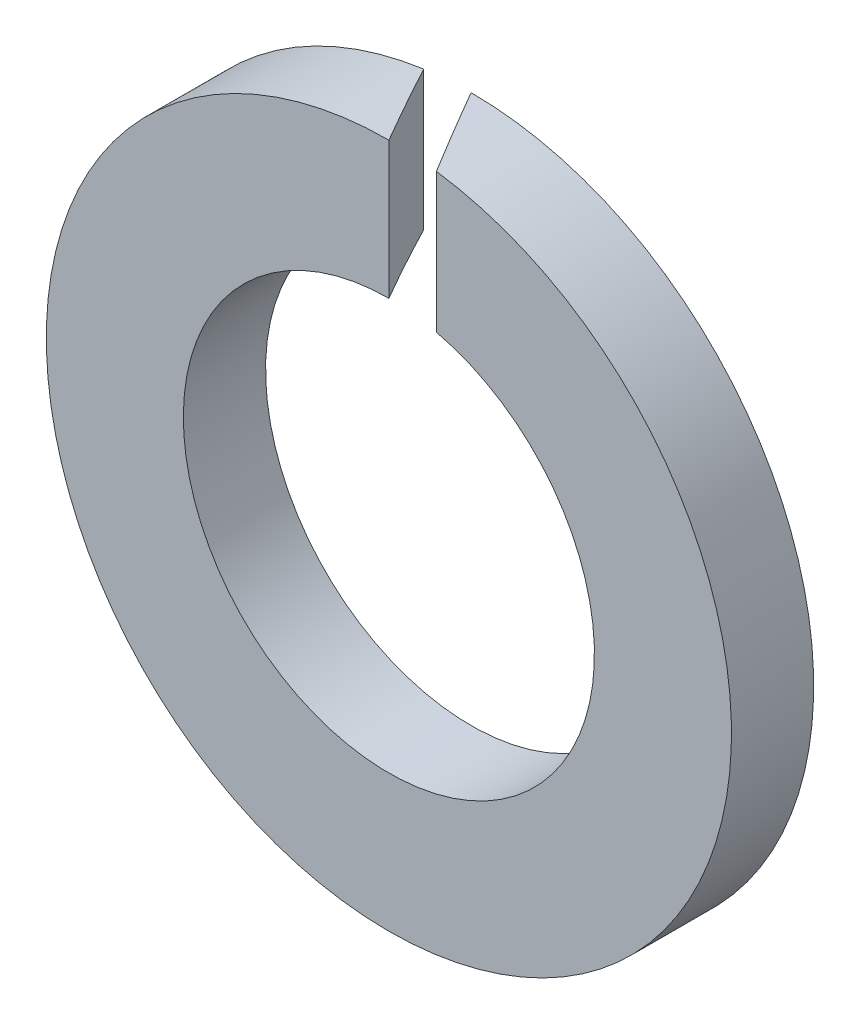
from build123d import *

# Parameters (mm, degrees)
SKETCH1_R          = 2.5
SKETCH1_R_2        = 1.5
BASE_EXTRUDE_DEPTH = 0.6
CUT_EXTRUDE1_DEPTH = 4.586084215


with BuildPart() as part:
    # Sketch1 → Base-Extrude (new body)
    with BuildSketch(Plane.XY):
        Circle(SKETCH1_R)
        Circle(SKETCH1_R_2, mode=Mode.SUBTRACT)
    extrude(amount=-BASE_EXTRUDE_DEPTH)

    # Sketch2 → Cut-Extrude1 (cut, through all)
    with BuildSketch(Plane(origin=(0, 0, 0), x_dir=(1, 0, 0), z_dir=(0, 1, 0))):
        Polygon((0, 0.6), (0.346410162, 0), (0, 0), (-0.346410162, 0.6), align=None)
    extrude(amount=CUT_EXTRUDE1_DEPTH, mode=Mode.SUBTRACT)


solid = part.part
